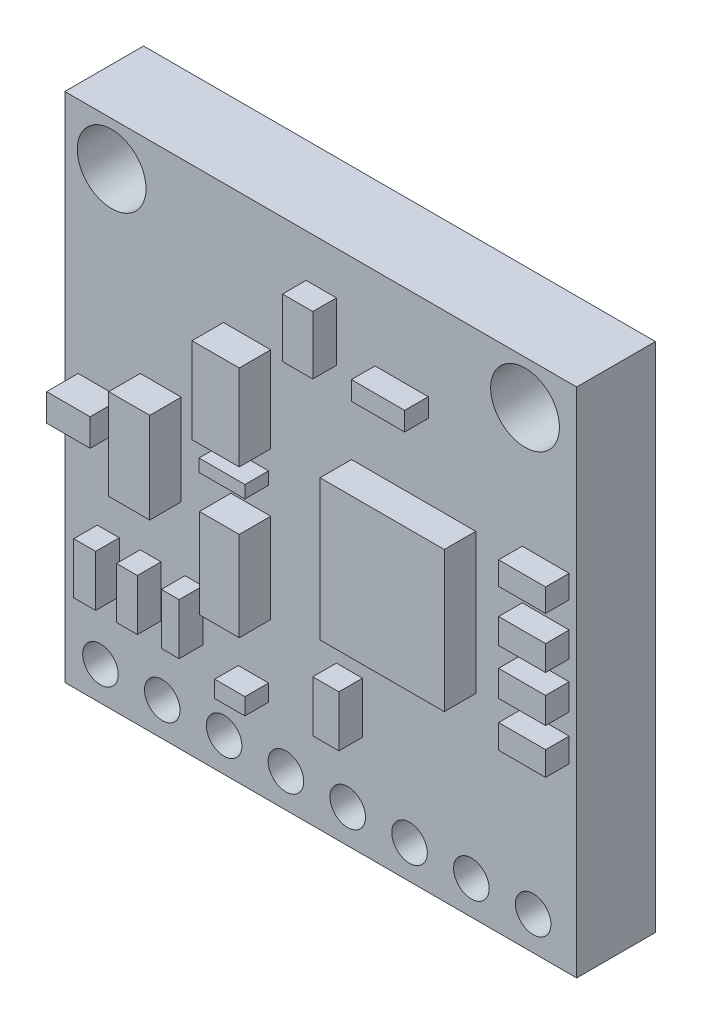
from build123d import *

# Parameters (mm, degrees)
SKETCH_1_W          = 1.3
SKETCH_1_H          = 1.3
EXTRUDE_1_DEPTH     = 0.2
SKETCH_2_R          = 0.045152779
SKETCH_2_R_2        = 0.087300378
CUT_EXTRUDE_1_DEPTH = 0.2
SKETCH_3_W          = 0.315635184
SKETCH_3_H          = 0.356667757
SKETCH_3_W_2        = 0.101003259
SKETCH_3_H_2        = 0.227257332
SKETCH_3_W_3        = 0.11994137
SKETCH_3_H_3        = 0.217788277
SKETCH_3_W_4        = 0.104159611
SKETCH_3_H_4        = 0.230413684
SKETCH_3_W_5        = 0.110472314
SKETCH_3_H_5        = 0.06943974
EXTRUDE_2_DEPTH     = 0.08
SKETCH_4_W          = 0.076892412
SKETCH_4_H          = 0.148481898
SKETCH_4_W_2        = 0.135224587
SKETCH_4_H_2        = 0.047726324
SKETCH_4_W_3        = 0.119315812
SKETCH_4_H_3        = 0.058332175
SKETCH_4_H_4        = 0.063635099
SKETCH_4_H_5        = 0.066286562
SKETCH_4_H_6        = 0.060983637
SKETCH_4_W_4        = 0.055680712
SKETCH_4_H_7        = 0.129921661
SKETCH_4_W_5        = 0.05302925
SKETCH_4_W_6        = 0.045074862
SKETCH_4_H_8        = 0.0424234
SKETCH_4_W_7        = 0.066286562
SKETCH_4_W_8        = 0.116664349
SKETCH_4_H_9        = 0.03181755
EXTRUDE_3_DEPTH     = 0.06


with BuildPart() as part:
    # Sketch 1 → Extrude 1 (new body)
    with BuildSketch(Plane.XY):
        with Locations((-61.967304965, 10.954113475)):
            Rectangle(SKETCH_1_W, SKETCH_1_H)
    extrude(amount=EXTRUDE_1_DEPTH)

    # Sketch 2 → Cut-Extrude 1 (cut)
    with BuildSketch(Plane.XY.offset(0.2)):
        with Locations((-62.526763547, 10.389351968)):
            Circle(SKETCH_2_R)
        with Locations((-62.369763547, 10.389351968)):
            Circle(SKETCH_2_R)
        with Locations((-62.212763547, 10.389351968)):
            Circle(SKETCH_2_R)
        with Locations((-62.055763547, 10.389351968)):
            Circle(SKETCH_2_R)
        with Locations((-61.898763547, 10.389351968)):
            Circle(SKETCH_2_R)
        with Locations((-61.741763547, 10.389351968)):
            Circle(SKETCH_2_R)
        with Locations((-61.584763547, 10.389351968)):
            Circle(SKETCH_2_R)
        with Locations((-61.427763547, 10.389351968)):
            Circle(SKETCH_2_R)
        with Locations((-62.498397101, 11.493096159)):
            Circle(SKETCH_2_R_2)
        with Locations((-61.448397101, 11.493096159)):
            Circle(SKETCH_2_R_2)
    extrude(amount=-CUT_EXTRUDE_1_DEPTH, mode=Mode.SUBTRACT)

    # Sketch 3 → Extrude 2 (add)
    with BuildSketch(Plane.XY.offset(0.2)):
        with Locations((-61.731403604, 10.980188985)):
            Rectangle(SKETCH_3_W, SKETCH_3_H)
        with Locations((-62.144885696, 10.817636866)):
            Rectangle(SKETCH_3_W_2, SKETCH_3_H_2)
        with Locations((-62.154354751, 11.188508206)):
            Rectangle(SKETCH_3_W_3, SKETCH_3_H_3)
        with Locations((-62.373721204, 10.964407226)):
            Rectangle(SKETCH_3_W_4, SKETCH_3_H_4)
        with Locations((-62.528382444, 10.965985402)):
            Rectangle(SKETCH_3_W_5, SKETCH_3_H_5)
    extrude(amount=EXTRUDE_2_DEPTH)

    # Sketch 4 → Extrude 3 (add)
    with BuildSketch(Plane.XY.offset(0.2)):
        with Locations((-61.965979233, 11.420770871)):
            Rectangle(SKETCH_4_W, SKETCH_4_H)
        with Locations((-61.761816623, 11.370393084)):
            Rectangle(SKETCH_4_W_2, SKETCH_4_H_2)
        with Locations((-61.395914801, 11.155624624)):
            Rectangle(SKETCH_4_W_3, SKETCH_4_H_3)
        with Locations((-61.395914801, 11.028354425)):
            Rectangle(SKETCH_4_W_3, SKETCH_4_H_4)
        with Locations((-61.395914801, 10.913015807)):
            Rectangle(SKETCH_4_W_3, SKETCH_4_H_5)
        with Locations((-61.395914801, 10.796351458)):
            Rectangle(SKETCH_4_W_3, SKETCH_4_H_6)
        with Locations((-62.506877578, 10.626657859)):
            Rectangle(SKETCH_4_W_4, SKETCH_4_H_7)
        with Locations((-62.399493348, 10.626657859)):
            Rectangle(SKETCH_4_W_5, SKETCH_4_H_7)
        with Locations((-62.289457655, 10.626657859)):
            Rectangle(SKETCH_4_W_6, SKETCH_4_H_7)
        with Locations((-62.138324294, 10.540485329)):
            Rectangle(SKETCH_4_W, SKETCH_4_H_8)
        with Locations((-61.894389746, 10.626657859)):
            Rectangle(SKETCH_4_W_7, SKETCH_4_H_7)
        with Locations((-62.158210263, 11.01244565)):
            Rectangle(SKETCH_4_W_8, SKETCH_4_H_9)
    extrude(amount=EXTRUDE_3_DEPTH)


solid = part.part
